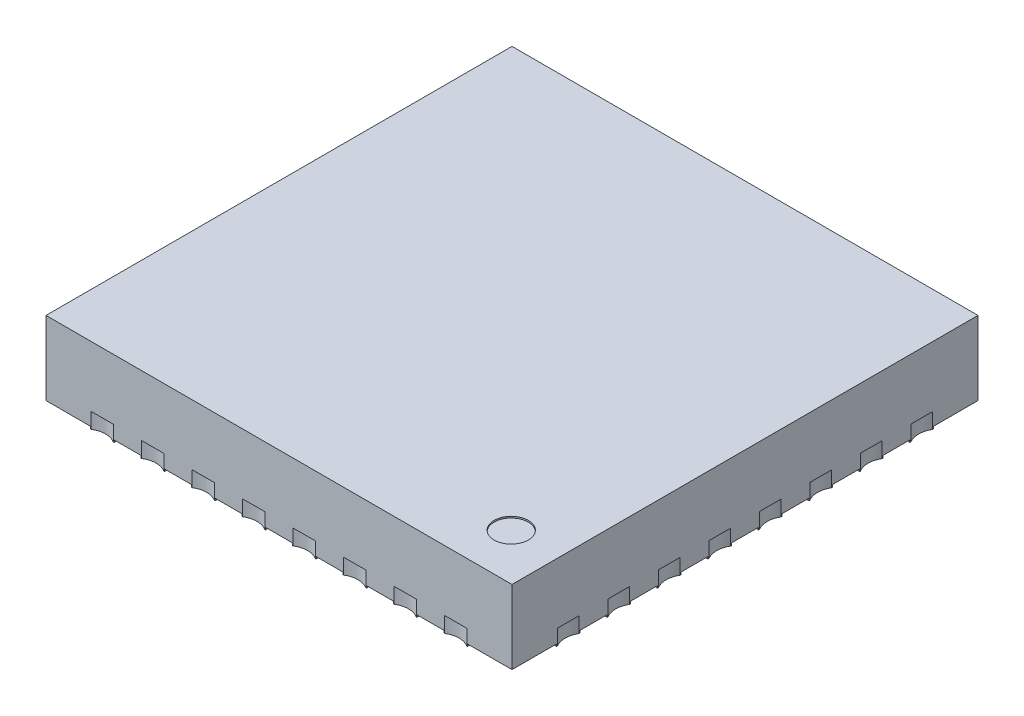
from build123d import *

# Parameters (mm, degrees)
SKETCH1_W           = 6
SKETCH1_H           = 6
BASE_EXTRUDE_DEPTH  = 0.95
SKETCH2_R           = 0.005
SKETCH2_W           = 0.3
SKETCH2_H           = 0.4
SKETCH2_W_2         = 0.4
SKETCH2_H_2         = 0.3
BOSS_EXTRUDE1_DEPTH = 0.03
SKETCH3_R           = 0.270057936
CUT_EXTRUDE1_DEPTH  = 0.2
SKETCH5_R           = 0.22
CUT_EXTRUDE3_DEPTH  = 0.02


with BuildPart() as part:
    # Sketch1 → Base-Extrude (new body)
    with BuildSketch(Plane(origin=(0, 0, 0), x_dir=(1, 0, 0), z_dir=(0, 1, 0))):
        with Locations((3, 3)):
            Rectangle(SKETCH1_W, SKETCH1_H)
    extrude(amount=BASE_EXTRUDE_DEPTH)

    # Sketch2 → Boss-Extrude1 (add)
    # profile 1 of 33: a face of its own
    with BuildSketch(Plane.XZ):
        Polygon((0.7, -0.7), (5, -0.7), (5.3, -1), (5.3, -5.3), (0.7, -5.3), align=None)
        with Locations(Location((3, -2.45, 0), (0, 0, 270))):
            Circle(SKETCH2_R, mode=Mode.SUBTRACT)
    # profile 2 of 33: a face of its own
    with BuildSketch(Plane.XZ):
        with Locations((1.375, -0.2)):
            Rectangle(SKETCH2_W, SKETCH2_H)
    # profile 3 of 33: a face of its own
    with BuildSketch(Plane.XZ):
        with Locations((0.725, -0.2)):
            Rectangle(SKETCH2_W, SKETCH2_H)
    # profile 4 of 33: a face of its own
    with BuildSketch(Plane.XZ):
        with Locations((2.025, -0.2)):
            Rectangle(SKETCH2_W, SKETCH2_H)
    # profile 5 of 33: a face of its own
    with BuildSketch(Plane.XZ):
        with Locations((2.675, -0.2)):
            Rectangle(SKETCH2_W, SKETCH2_H)
    # profile 6 of 33: a face of its own
    with BuildSketch(Plane.XZ):
        with Locations((3.325, -0.2)):
            Rectangle(SKETCH2_W, SKETCH2_H)
    # profile 7 of 33: a face of its own
    with BuildSketch(Plane.XZ):
        with Locations((3.975, -0.2)):
            Rectangle(SKETCH2_W, SKETCH2_H)
    # profile 8 of 33: a face of its own
    with BuildSketch(Plane.XZ):
        with Locations((4.625, -0.2)):
            Rectangle(SKETCH2_W, SKETCH2_H)
    # profile 9 of 33: a face of its own
    with BuildSketch(Plane.XZ):
        with Locations((5.275, -0.2)):
            Rectangle(SKETCH2_W, SKETCH2_H)
    # profile 10 of 33: a face of its own
    with BuildSketch(Plane.XZ):
        with Locations((1.375, -5.8)):
            Rectangle(SKETCH2_W, SKETCH2_H)
    # profile 11 of 33: a face of its own
    with BuildSketch(Plane.XZ):
        with Locations((0.725, -5.8)):
            Rectangle(SKETCH2_W, SKETCH2_H)
    # profile 12 of 33: a face of its own
    with BuildSketch(Plane.XZ):
        with Locations((2.025, -5.8)):
            Rectangle(SKETCH2_W, SKETCH2_H)
    # profile 13 of 33: a face of its own
    with BuildSketch(Plane.XZ):
        with Locations((2.675, -5.8)):
            Rectangle(SKETCH2_W, SKETCH2_H)
    # profile 14 of 33: a face of its own
    with BuildSketch(Plane.XZ):
        with Locations((3.325, -5.8)):
            Rectangle(SKETCH2_W, SKETCH2_H)
    # profile 15 of 33: a face of its own
    with BuildSketch(Plane.XZ):
        with Locations((3.975, -5.8)):
            Rectangle(SKETCH2_W, SKETCH2_H)
    # profile 16 of 33: a face of its own
    with BuildSketch(Plane.XZ):
        with Locations((4.625, -5.8)):
            Rectangle(SKETCH2_W, SKETCH2_H)
    # profile 17 of 33: a face of its own
    with BuildSketch(Plane.XZ):
        with Locations((5.275, -5.8)):
            Rectangle(SKETCH2_W, SKETCH2_H)
    # profile 18 of 33: a face of its own
    with BuildSketch(Plane.XZ):
        with Locations((5.8, -0.725)):
            Rectangle(SKETCH2_W_2, SKETCH2_H_2)
    # profile 19 of 33: a face of its own
    with BuildSketch(Plane.XZ):
        with Locations((0.2, -0.725)):
            Rectangle(SKETCH2_W_2, SKETCH2_H_2)
    # profile 20 of 33: a face of its own
    with BuildSketch(Plane.XZ):
        with Locations((0.2, -1.375)):
            Rectangle(SKETCH2_W_2, SKETCH2_H_2)
    # profile 21 of 33: a face of its own
    with BuildSketch(Plane.XZ):
        with Locations((5.8, -1.375)):
            Rectangle(SKETCH2_W_2, SKETCH2_H_2)
    # profile 22 of 33: a face of its own
    with BuildSketch(Plane.XZ):
        with Locations((0.2, -2.025)):
            Rectangle(SKETCH2_W_2, SKETCH2_H_2)
    # profile 23 of 33: a face of its own
    with BuildSketch(Plane.XZ):
        with Locations((5.8, -2.025)):
            Rectangle(SKETCH2_W_2, SKETCH2_H_2)
    # profile 24 of 33: a face of its own
    with BuildSketch(Plane.XZ):
        with Locations((0.2, -2.675)):
            Rectangle(SKETCH2_W_2, SKETCH2_H_2)
    # profile 25 of 33: a face of its own
    with BuildSketch(Plane.XZ):
        with Locations((5.8, -2.675)):
            Rectangle(SKETCH2_W_2, SKETCH2_H_2)
    # profile 26 of 33: a face of its own
    with BuildSketch(Plane.XZ):
        with Locations((0.2, -3.325)):
            Rectangle(SKETCH2_W_2, SKETCH2_H_2)
    # profile 27 of 33: a face of its own
    with BuildSketch(Plane.XZ):
        with Locations((5.8, -3.325)):
            Rectangle(SKETCH2_W_2, SKETCH2_H_2)
    # profile 28 of 33: a face of its own
    with BuildSketch(Plane.XZ):
        with Locations((0.2, -3.975)):
            Rectangle(SKETCH2_W_2, SKETCH2_H_2)
    # profile 29 of 33: a face of its own
    with BuildSketch(Plane.XZ):
        with Locations((5.8, -3.975)):
            Rectangle(SKETCH2_W_2, SKETCH2_H_2)
    # profile 30 of 33: a face of its own
    with BuildSketch(Plane.XZ):
        with Locations((0.2, -4.625)):
            Rectangle(SKETCH2_W_2, SKETCH2_H_2)
    # profile 31 of 33: a face of its own
    with BuildSketch(Plane.XZ):
        with Locations((5.8, -4.625)):
            Rectangle(SKETCH2_W_2, SKETCH2_H_2)
    # profile 32 of 33: a face of its own
    with BuildSketch(Plane.XZ):
        with Locations((0.2, -5.275)):
            Rectangle(SKETCH2_W_2, SKETCH2_H_2)
    # profile 33 of 33: a face of its own
    with BuildSketch(Plane.XZ):
        with Locations((5.8, -5.275)):
            Rectangle(SKETCH2_W_2, SKETCH2_H_2)
    extrude(amount=BOSS_EXTRUDE1_DEPTH)

    # Sketch3 → Cut-Extrude1 (cut)
    with BuildSketch(Plane.XZ.offset(0.03)):
        with Locations((-0.230766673, -0.725)):
            Circle(SKETCH3_R)
        with Locations((0.725, -6.228552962)):
            Circle(SKETCH3_R)
        with Locations((6.230766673, -0.725)):
            Circle(SKETCH3_R)
        with Locations((1.375, 0.228552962)):
            Circle(SKETCH3_R)
        with Locations((1.375, -6.228552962)):
            Circle(SKETCH3_R)
        with Locations((2.025, 0.228552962)):
            Circle(SKETCH3_R)
        with Locations((0.725, 0.228552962)):
            Circle(SKETCH3_R)
        with Locations((2.025, -6.228552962)):
            Circle(SKETCH3_R)
        with Locations((2.675, 0.228552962)):
            Circle(SKETCH3_R)
        with Locations((2.675, -6.228552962)):
            Circle(SKETCH3_R)
        with Locations((3.325, 0.228552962)):
            Circle(SKETCH3_R)
        with Locations((3.325, -6.228552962)):
            Circle(SKETCH3_R)
        with Locations((3.975, 0.228552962)):
            Circle(SKETCH3_R)
        with Locations((3.975, -6.228552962)):
            Circle(SKETCH3_R)
        with Locations((4.625, 0.228552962)):
            Circle(SKETCH3_R)
        with Locations((4.625, -6.228552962)):
            Circle(SKETCH3_R)
        with Locations((5.275, 0.228552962)):
            Circle(SKETCH3_R)
        with Locations((5.275, -6.228552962)):
            Circle(SKETCH3_R)
        with Locations((-0.230766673, -1.375)):
            Circle(SKETCH3_R)
        with Locations((6.230766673, -1.375)):
            Circle(SKETCH3_R)
        with Locations((-0.230766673, -2.025)):
            Circle(SKETCH3_R)
        with Locations((6.230766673, -2.025)):
            Circle(SKETCH3_R)
        with Locations((-0.230766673, -2.675)):
            Circle(SKETCH3_R)
        with Locations((6.230766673, -2.675)):
            Circle(SKETCH3_R)
        with Locations((-0.230766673, -3.325)):
            Circle(SKETCH3_R)
        with Locations((6.230766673, -3.325)):
            Circle(SKETCH3_R)
        with Locations((-0.230766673, -3.975)):
            Circle(SKETCH3_R)
        with Locations((6.230766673, -3.975)):
            Circle(SKETCH3_R)
        with Locations((-0.230766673, -4.625)):
            Circle(SKETCH3_R)
        with Locations((6.230766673, -4.625)):
            Circle(SKETCH3_R)
        with Locations((-0.230766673, -5.275)):
            Circle(SKETCH3_R)
        with Locations((6.230766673, -5.275)):
            Circle(SKETCH3_R)
    extrude(amount=-CUT_EXTRUDE1_DEPTH, mode=Mode.SUBTRACT)

    # Sketch5 → Cut-Extrude3 (cut)
    with BuildSketch(Plane(origin=(0, 0.95, 0), x_dir=(-1, 0, 0), z_dir=(0, 1, 0))):
        with Locations(Location((-5.39, -0.6, 0), (0, 0, 90))):
            Circle(SKETCH5_R)
    extrude(amount=-CUT_EXTRUDE3_DEPTH, mode=Mode.SUBTRACT)


solid = part.part
